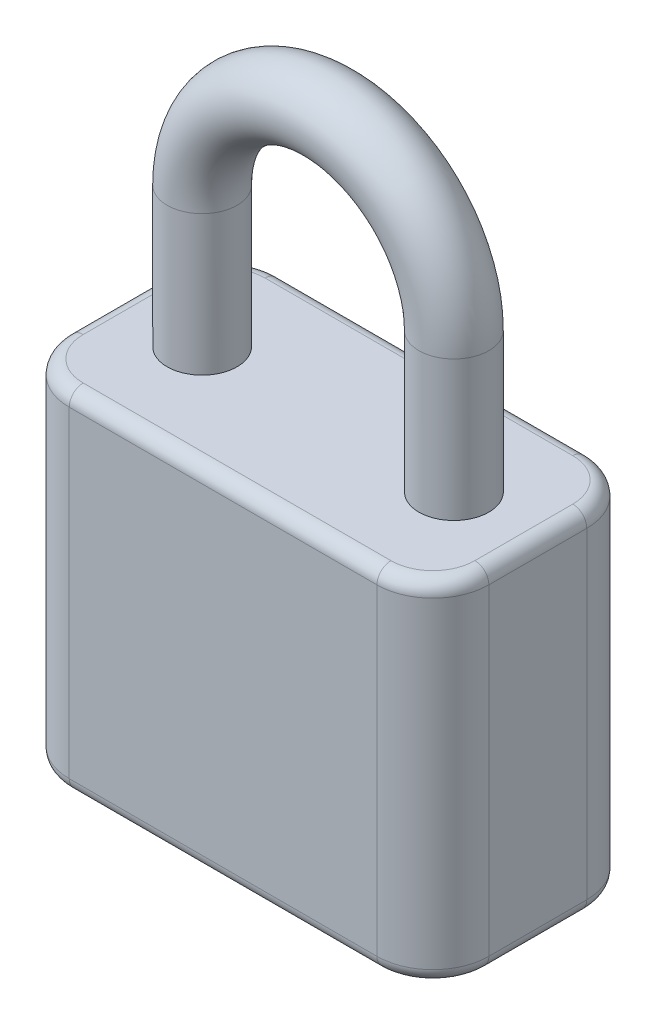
from build123d import *

# Parameters (mm, degrees)
SKETCH1_W           = 76.2
SKETCH1_H           = 38.1
BOSS_EXTRUDE1_DEPTH = 63.5
FILLET1_R           = 10.16
FILLET2_R           = 2.54
SKETCH2_R           = 6.35
SKETCH3_R           = 15.24
BOSS_EXTRUDE2_DEPTH = 1.27
SKETCH21_R          = 3.81
CUT_EXTRUDE1_DEPTH  = 25.4


with BuildPart() as part:
    # Sketch1 → Boss-Extrude1 (new body)
    with BuildSketch(Plane(origin=(0, 0, 0), x_dir=(1, 0, 0), z_dir=(0, 1, 0))):
        Rectangle(SKETCH1_W, SKETCH1_H)
    extrude(amount=BOSS_EXTRUDE1_DEPTH)

    # Fillet1
    fillet1_edges = [part.edges().sort_by_distance(p)[0] for p in [
        (38.1, 31.75, 19.05),
        (-38.1, 31.75, 19.05),
        (-38.1, 31.75, -19.05),
        (38.1, 31.75, -19.05),
    ]]
    fillet(fillet1_edges, radius=FILLET1_R)

    # Fillet2
    fillet2_edges = [part.edges().sort_by_distance(p)[0] for p in [
        (0, 0, -19.05),
        (0, 63.5, -19.05),
        (38.1, 0, 0),
        (0, 0, 19.05),
        (-38.1, 0, 0),
        (35.124204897, 0, 16.074204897),
        (-35.124204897, 0, 16.074204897),
        (-35.124204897, 0, -16.074204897),
        (35.124204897, 0, -16.074204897),
        (38.1, 63.5, 0),
        (-38.1, 63.5, 0),
        (0, 63.5, 19.05),
        (35.124204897, 63.5, 16.074204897),
        (-35.124204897, 63.5, 16.074204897),
        (-35.124204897, 63.5, -16.074204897),
        (35.124204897, 63.5, -16.074204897),
    ]]
    fillet(fillet2_edges, radius=FILLET2_R)

    # Sweep1: sweep along a curve in space
    with BuildLine() as sweep1_path:
        Line((-22.86, 63.5, 0), (-22.86, 88.9, 0))
        ThreePointArc((-22.86, 88.9, 0), (0, 111.76, 0), (22.86, 88.9, 0))
        Line((22.86, 88.9, 0), (22.86, 63.5, 0))
    # Sketch2 → Sweep1 (sweep)
    with BuildSketch(Plane(origin=(0, 63.5, 0), x_dir=(1, 0, 0), z_dir=(0, 1, 0))):
        with Locations((-22.86, 0)):
            Circle(SKETCH2_R)
    sweep(path=sweep1_path.line)

    # Sketch3 → Boss-Extrude2 (add)
    with BuildSketch(Plane.XZ):
        with Locations(Location((0, 0, 0), (0, 0, 270))):
            Circle(SKETCH3_R)
    extrude(amount=BOSS_EXTRUDE2_DEPTH)

    # Sketch21 → Cut-Extrude1 (cut)
    with BuildSketch(Plane(origin=(-0.064684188, -1.27, -1.107843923), x_dir=(-1, 0, 0), z_dir=(0, -1, 0))):
        with Locations((-0.064684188, -6.187843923)):
            Circle(SKETCH21_R)
        with BuildLine():
            Line((1.840315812, 3.972156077), (1.840315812, -6.187843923))
            ThreePointArc((1.840315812, -6.187843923), (-0.064684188, -8.092843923), (-1.969684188, -6.187843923))
            Line((-1.969684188, -6.187843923), (-1.969684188, 3.972156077))
            ThreePointArc((-1.969684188, 3.972156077), (-0.064684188, 5.877156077), (1.840315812, 3.972156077))
        make_face()
    extrude(amount=-CUT_EXTRUDE1_DEPTH, mode=Mode.SUBTRACT)


solid = part.part
